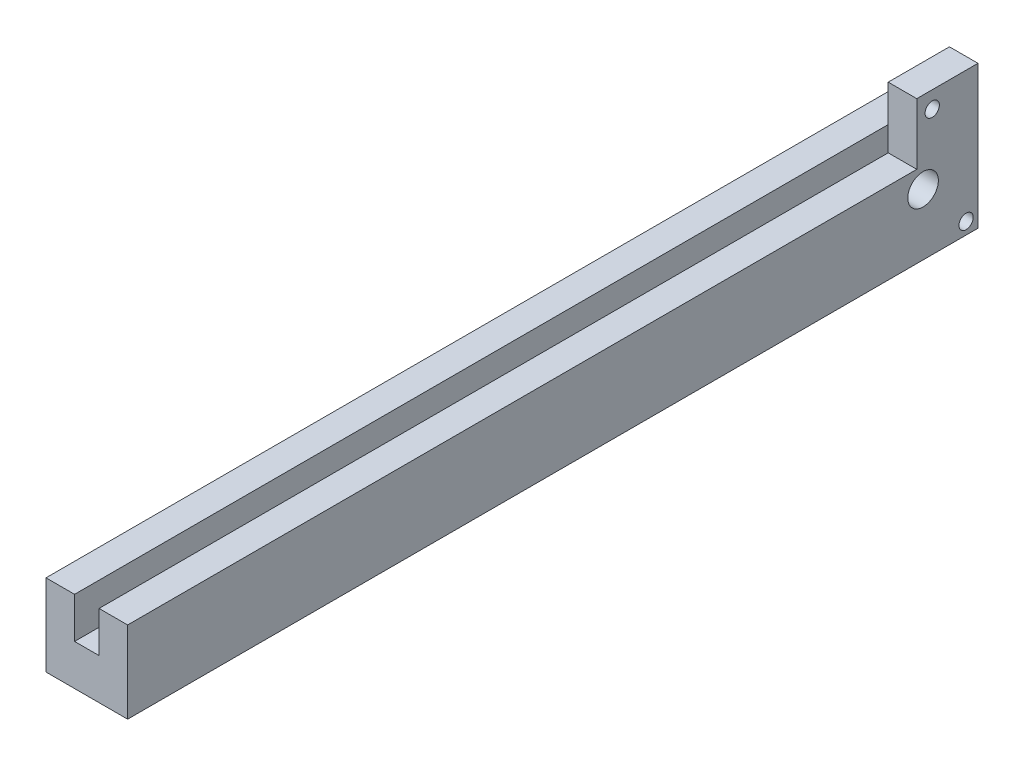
from build123d import *

# Parameters (mm, degrees)
SKETCH1_W           = 24
SKETCH1_H           = 24
BOSS_EXTRUDE1_DEPTH = 250
SKETCH2_W           = 3.6
SKETCH2_H           = 12
CUT_EXTRUDE1_DEPTH  = 250
SKETCH8_W           = 8.4
SKETCH8_H           = 18
BOSS_EXTRUDE2_DEPTH = 18
SKETCH6_R           = 2.1
SKETCH6_R_2         = 4.5
CUT_EXTRUDE3_DEPTH  = 8.4


with BuildPart() as part:
    # Sketch1 → Boss-Extrude1 (new body)
    with BuildSketch(Plane.XY):
        Rectangle(SKETCH1_W, SKETCH1_H)
    extrude(amount=BOSS_EXTRUDE1_DEPTH)

    # Sketch2 → Cut-Extrude1 (cut)
    with BuildSketch(Plane.XY.offset(250)):
        with Locations((1.8, 6)):
            Rectangle(SKETCH2_W, SKETCH2_H)
    cut_extrude1 = extrude(amount=-CUT_EXTRUDE1_DEPTH, mode=Mode.SUBTRACT)

    # Mirror1: Cut-Extrude1 across plane
    add(cut_extrude1.mirror(Plane(origin=(0, 0, 0), x_dir=(0, 0, 1), z_dir=(1, 0, 0))), mode=Mode.SUBTRACT)

    # Sketch8 → Boss-Extrude2 (add)
    with BuildSketch(Plane(origin=(0, 12, 0), x_dir=(1, 0, 0), z_dir=(0, 1, 0))):
        with Locations((7.8, -9)):
            Rectangle(SKETCH8_W, SKETCH8_H)
    extrude(amount=BOSS_EXTRUDE2_DEPTH)

    # Sketch6 → Cut-Extrude3 (cut)
    with BuildSketch(Plane(origin=(12, 0, 0), x_dir=(0, 0, -1), z_dir=(1, 0, 0))):
        with Locations(Location((-3.5, -8.5, 0), (0, 0, 90))):
            Circle(SKETCH6_R)
        with Locations(Location((-16.149110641, 6, 0), (0, 0, 90))):
            Circle(SKETCH6_R_2)
        with Locations(Location((-13.459703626, 25.053007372, 0), (0, 0, 90))):
            Circle(SKETCH6_R)
    extrude(amount=-CUT_EXTRUDE3_DEPTH, mode=Mode.SUBTRACT)


solid = part.part
